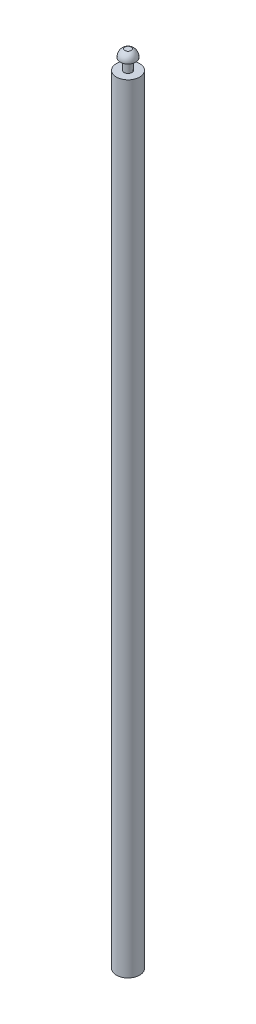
ISO-10303-21;
HEADER;
FILE_DESCRIPTION(('STEP AP214'),'2;1');
FILE_NAME('part.step','',(''),(''),'','','');
FILE_SCHEMA(('AUTOMOTIVE_DESIGN { 1 0 10303 214 1 1 1 1 }'));
ENDSEC;
DATA;
#1=APPLICATION_CONTEXT('core data for automotive mechanical design processes');
#2=APPLICATION_PROTOCOL_DEFINITION('international standard','automotive_design',2000,#1);
#3=PRODUCT_CONTEXT('',#1,'mechanical');
#4=PRODUCT('Part','Part','',(#3));
#5=PRODUCT_RELATED_PRODUCT_CATEGORY('part','',(#4));
#6=PRODUCT_DEFINITION_FORMATION('','',#4);
#7=PRODUCT_DEFINITION_CONTEXT('part definition',#1,'design');
#8=PRODUCT_DEFINITION('design','',#6,#7);
#9=PRODUCT_DEFINITION_SHAPE('','',#8);
#10=(LENGTH_UNIT() NAMED_UNIT(*) SI_UNIT(.MILLI.,.METRE.));
#11=(NAMED_UNIT(*) PLANE_ANGLE_UNIT() SI_UNIT($,.RADIAN.));
#12=(NAMED_UNIT(*) SI_UNIT($,.STERADIAN.) SOLID_ANGLE_UNIT());
#13=UNCERTAINTY_MEASURE_WITH_UNIT(LENGTH_MEASURE(1.E-05),#10,'distance_accuracy_value','');
#14=(GEOMETRIC_REPRESENTATION_CONTEXT(3) GLOBAL_UNCERTAINTY_ASSIGNED_CONTEXT((#13)) GLOBAL_UNIT_ASSIGNED_CONTEXT((#10,
#11,#12)) REPRESENTATION_CONTEXT('',''));
#15=CARTESIAN_POINT('',(0.,0.,0.));
#16=DIRECTION('',(0.,0.,1.));
#17=DIRECTION('',(1.,0.,0.));
#18=AXIS2_PLACEMENT_3D('',#15,#16,#17);
#19=CARTESIAN_POINT('',(0.,0.,0.));
#20=DIRECTION('',(0.,-1.,0.));
#21=DIRECTION('',(0.,0.,-1.));
#22=AXIS2_PLACEMENT_3D('',#19,#20,#21);
#23=CYLINDRICAL_SURFACE('',#22,0.25);
#24=CARTESIAN_POINT('',(0.,35.107250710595,0.));
#25=DIRECTION('',(0.,-1.,0.));
#26=DIRECTION('',(0.,0.,-1.));
#27=AXIS2_PLACEMENT_3D('',#24,#25,#26);
#28=CIRCLE('',#27,0.25);
#29=CARTESIAN_POINT('',(0.,35.107250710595,-0.25));
#30=VERTEX_POINT('',#29);
#31=EDGE_CURVE('E10',#30,#30,#28,.T.);
#32=ORIENTED_EDGE('',*,*,#31,.F.);
#33=EDGE_LOOP('',(#32));
#34=FACE_BOUND('',#33,.T.);
#35=CARTESIAN_POINT('',(0.,35.807250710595,0.));
#36=DIRECTION('',(0.,-1.,0.));
#37=DIRECTION('',(0.,0.,-1.));
#38=AXIS2_PLACEMENT_3D('',#35,#36,#37);
#39=CIRCLE('',#38,0.25);
#40=CARTESIAN_POINT('',(0.,35.807250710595,-0.25));
#41=VERTEX_POINT('',#40);
#42=EDGE_CURVE('E39',#41,#41,#39,.T.);
#43=ORIENTED_EDGE('',*,*,#42,.T.);
#44=EDGE_LOOP('',(#43));
#45=FACE_BOUND('',#44,.T.);
#46=ADVANCED_FACE('F33',(#34,#45),#23,.T.);
#47=CARTESIAN_POINT('',(-0.25,35.807250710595,0.));
#48=DIRECTION('',(0.,1.,0.));
#49=DIRECTION('',(0.,0.,1.));
#50=AXIS2_PLACEMENT_3D('',#47,#48,#49);
#51=PLANE('',#50);
#52=ORIENTED_EDGE('',*,*,#42,.F.);
#53=EDGE_LOOP('',(#52));
#54=FACE_BOUND('',#53,.T.);
#55=CARTESIAN_POINT('',(0.,35.807250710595,0.));
#56=DIRECTION('',(0.,-1.,0.));
#57=DIRECTION('',(0.,0.,-1.));
#58=AXIS2_PLACEMENT_3D('',#55,#56,#57);
#59=CIRCLE('',#58,0.500000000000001);
#60=CARTESIAN_POINT('',(-0.500000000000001,35.807250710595,0.));
#61=VERTEX_POINT('',#60);
#62=EDGE_CURVE('E43',#61,#61,#59,.T.);
#63=ORIENTED_EDGE('',*,*,#62,.T.);
#64=EDGE_LOOP('',(#63));
#65=FACE_BOUND('',#64,.T.);
#66=ADVANCED_FACE('F76',(#54,#65),#51,.F.);
#67=CARTESIAN_POINT('',(0.,35.847250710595,0.));
#68=DIRECTION('',(0.,-1.,0.));
#69=DIRECTION('',(-1.,0.,0.));
#70=AXIS2_PLACEMENT_3D('',#67,#68,#69);
#71=SPHERICAL_SURFACE('',#70,0.501597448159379);
#72=CARTESIAN_POINT('',(0.,36.307250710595,0.));
#73=DIRECTION('',(0.,-1.,0.));
#74=DIRECTION('',(0.,0.,-1.));
#75=AXIS2_PLACEMENT_3D('',#72,#73,#74);
#76=CIRCLE('',#75,0.2);
#77=CARTESIAN_POINT('',(-0.19999999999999,36.307250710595,0.));
#78=VERTEX_POINT('',#77);
#79=EDGE_CURVE('E47',#78,#78,#76,.T.);
#80=CARTESIAN_POINT('',(-0.500000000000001,35.807250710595,0.));
#81=CARTESIAN_POINT('',(-0.50051694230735,35.8137116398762,0.));
#82=CARTESIAN_POINT('',(-0.500908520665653,35.8201825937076,0.));
#83=CARTESIAN_POINT('',(-0.501440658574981,35.8331348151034,0.));
#84=CARTESIAN_POINT('',(-0.501581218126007,35.8396160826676,0.));
#85=CARTESIAN_POINT('',(-0.501611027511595,35.8525791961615,0.));
#86=CARTESIAN_POINT('',(-0.501500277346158,35.8590610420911,0.));
#87=CARTESIAN_POINT('',(-0.501027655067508,35.8720155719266,0.));
#88=CARTESIAN_POINT('',(-0.500665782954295,35.8784882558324,0.));
#89=CARTESIAN_POINT('',(-0.499691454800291,35.8914147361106,0.));
#90=CARTESIAN_POINT('',(-0.4990789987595,35.8978685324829,0.));
#91=CARTESIAN_POINT('',(-0.49760442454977,35.9107475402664,0.));
#92=CARTESIAN_POINT('',(-0.49674230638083,35.9171727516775,0.));
#93=CARTESIAN_POINT('',(-0.494769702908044,35.9299849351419,0.));
#94=CARTESIAN_POINT('',(-0.493659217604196,35.9363719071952,0.));
#95=CARTESIAN_POINT('',(-0.491191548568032,35.9490980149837,0.));
#96=CARTESIAN_POINT('',(-0.489834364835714,35.955437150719,0.));
#97=CARTESIAN_POINT('',(-0.486875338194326,35.968058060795,0.));
#98=CARTESIAN_POINT('',(-0.485273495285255,35.9743398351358,0.));
#99=CARTESIAN_POINT('',(-0.481827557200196,35.9868365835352,0.));
#100=CARTESIAN_POINT('',(-0.479983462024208,35.9930515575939,0.));
#101=CARTESIAN_POINT('',(-0.476055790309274,36.0054053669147,0.));
#102=CARTESIAN_POINT('',(-0.473972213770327,36.0115442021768,0.));
#103=CARTESIAN_POINT('',(-0.469568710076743,36.0237365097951,0.));
#104=CARTESIAN_POINT('',(-0.467248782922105,36.0297899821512,0.));
#105=CARTESIAN_POINT('',(-0.462376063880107,36.0418024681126,0.));
#106=CARTESIAN_POINT('',(-0.459823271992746,36.047761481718,0.));
#107=CARTESIAN_POINT('',(-0.454488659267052,36.0595760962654,0.));
#108=CARTESIAN_POINT('',(-0.451706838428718,36.0654316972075,0.));
#109=CARTESIAN_POINT('',(-0.445918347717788,36.0770306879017,0.));
#110=CARTESIAN_POINT('',(-0.442911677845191,36.082774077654,0.));
#111=CARTESIAN_POINT('',(-0.436678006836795,36.0941400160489,0.));
#112=CARTESIAN_POINT('',(-0.433451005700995,36.0997625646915,0.));
#113=CARTESIAN_POINT('',(-0.426781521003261,36.1108783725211,0.));
#114=CARTESIAN_POINT('',(-0.423339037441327,36.116371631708,0.));
#115=CARTESIAN_POINT('',(-0.416243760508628,36.1272206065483,0.));
#116=CARTESIAN_POINT('',(-0.412590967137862,36.1325763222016,0.));
#117=CARTESIAN_POINT('',(-0.405080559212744,36.1431421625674,0.));
#118=CARTESIAN_POINT('',(-0.401222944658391,36.1483522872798,0.));
#119=CARTESIAN_POINT('',(-0.39330869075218,36.1586191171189,0.));
#120=CARTESIAN_POINT('',(-0.389252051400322,36.1636758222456,0.));
#121=CARTESIAN_POINT('',(-0.380945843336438,36.1736282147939,0.));
#122=CARTESIAN_POINT('',(-0.376696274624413,36.1785239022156,0.));
#123=CARTESIAN_POINT('',(-0.368010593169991,36.1881469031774,0.));
#124=CARTESIAN_POINT('',(-0.363574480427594,36.1928742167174,0.));
#125=CARTESIAN_POINT('',(-0.35452237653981,36.2021533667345,0.));
#126=CARTESIAN_POINT('',(-0.349906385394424,36.2067052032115,0.));
#127=CARTESIAN_POINT('',(-0.340501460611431,36.2156265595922,0.));
#128=CARTESIAN_POINT('',(-0.335712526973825,36.2199960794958,0.));
#129=CARTESIAN_POINT('',(-0.325968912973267,36.2285462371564,0.));
#130=CARTESIAN_POINT('',(-0.321014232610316,36.2327268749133,0.));
#131=CARTESIAN_POINT('',(-0.310946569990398,36.2408929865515,0.));
#132=CARTESIAN_POINT('',(-0.305833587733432,36.2448784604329,0.));
#133=CARTESIAN_POINT('',(-0.29545700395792,36.2526482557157,0.));
#134=CARTESIAN_POINT('',(-0.290193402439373,36.2564325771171,0.));
#135=CARTESIAN_POINT('',(-0.279523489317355,36.2637943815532,0.));
#136=CARTESIAN_POINT('',(-0.274117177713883,36.2673718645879,0.));
#137=CARTESIAN_POINT('',(-0.263169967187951,36.2743146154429,0.));
#138=CARTESIAN_POINT('',(-0.257629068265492,36.2776798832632,0.));
#139=CARTESIAN_POINT('',(-0.246421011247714,36.2841931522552,0.));
#140=CARTESIAN_POINT('',(-0.240753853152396,36.2873411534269,0.));
#141=CARTESIAN_POINT('',(-0.229301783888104,36.2934151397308,0.));
#142=CARTESIAN_POINT('',(-0.223516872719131,36.2963411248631,0.));
#143=CARTESIAN_POINT('',(-0.211838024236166,36.3019667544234,0.));
#144=CARTESIAN_POINT('',(-0.205944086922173,36.3046663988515,0.));
#145=CARTESIAN_POINT('',(-0.19999999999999,36.307250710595,0.));
#146=B_SPLINE_CURVE_WITH_KNOTS('',3,(#80,#81,#82,#83,#84,#85,#86,#87,#88,#89,#90,#91,#92,#93,
#94,#95,#96,#97,#98,#99,#100,#101,#102,#103,#104,#105,#106,#107,#108,#109,#110,#111,#112,#113,
#114,#115,#116,#117,#118,#119,#120,#121,#122,#123,#124,#125,#126,#127,#128,#129,#130,#131,#132,
#133,#134,#135,#136,#137,#138,#139,#140,#141,#142,#143,#144,#145),.UNSPECIFIED.,.F.,.F.,(4,2,2,
2,2,2,2,2,2,2,2,2,2,2,2,2,2,2,2,2,2,2,2,2,2,2,2,2,2,2,2,2,4),(0.,0.0194435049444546,
0.0388870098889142,0.0583305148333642,0.0777740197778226,0.0972175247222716,0.116661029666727,
0.136104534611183,0.155548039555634,0.174991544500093,0.194435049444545,0.213878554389,
0.233322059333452,0.252765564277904,0.272209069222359,0.291652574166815,0.311096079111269,
0.330539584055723,0.349983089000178,0.369426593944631,0.388870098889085,0.408313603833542,
0.427757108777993,0.44720061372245,0.466644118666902,0.486087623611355,0.505531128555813,
0.524974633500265,0.54441813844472,0.563861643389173,0.583305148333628,0.602748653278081,
0.622192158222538),.UNSPECIFIED.);
#147=EDGE_CURVE('BSEAM81',#61,#78,#146,.T.);
#148=ORIENTED_EDGE('',*,*,#62,.F.);
#149=ORIENTED_EDGE('',*,*,#79,.T.);
#150=ORIENTED_EDGE('',*,*,#147,.T.);
#151=ORIENTED_EDGE('',*,*,#147,.F.);
#152=EDGE_LOOP('',(#148,#150,#149,#151));
#153=FACE_BOUND('',#152,.T.);
#154=ADVANCED_FACE('F81',(#153),#71,.T.);
#155=CARTESIAN_POINT('',(-0.2,36.307250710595,0.));
#156=DIRECTION('',(0.,-1.,0.));
#157=DIRECTION('',(0.,0.,-1.));
#158=AXIS2_PLACEMENT_3D('',#155,#156,#157);
#159=PLANE('',#158);
#160=ORIENTED_EDGE('',*,*,#79,.F.);
#161=EDGE_LOOP('',(#160));
#162=FACE_BOUND('',#161,.T.);
#163=ADVANCED_FACE('F64',(#162),#159,.F.);
#164=CARTESIAN_POINT('',(0.,-14.892749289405,0.));
#165=DIRECTION('',(0.,1.,0.));
#166=DIRECTION('',(0.,0.,1.));
#167=AXIS2_PLACEMENT_3D('',#164,#165,#166);
#168=CYLINDRICAL_SURFACE('',#167,0.75);
#169=CARTESIAN_POINT('',(0.,-14.892749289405,0.));
#170=DIRECTION('',(0.,-1.,0.));
#171=DIRECTION('',(0.,0.,-1.));
#172=AXIS2_PLACEMENT_3D('',#169,#170,#171);
#173=CIRCLE('',#172,0.75);
#174=CARTESIAN_POINT('',(0.,-14.892749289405,-0.75));
#175=VERTEX_POINT('',#174);
#176=EDGE_CURVE('E52',#175,#175,#173,.T.);
#177=ORIENTED_EDGE('',*,*,#176,.F.);
#178=EDGE_LOOP('',(#177));
#179=FACE_BOUND('',#178,.T.);
#180=CARTESIAN_POINT('',(0.,35.107250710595,0.));
#181=DIRECTION('',(0.,-1.,0.));
#182=DIRECTION('',(0.,0.,-1.));
#183=AXIS2_PLACEMENT_3D('',#180,#181,#182);
#184=CIRCLE('',#183,0.75);
#185=CARTESIAN_POINT('',(0.,35.107250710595,-0.75));
#186=VERTEX_POINT('',#185);
#187=EDGE_CURVE('E53',#186,#186,#184,.T.);
#188=ORIENTED_EDGE('',*,*,#187,.T.);
#189=EDGE_LOOP('',(#188));
#190=FACE_BOUND('',#189,.T.);
#191=ADVANCED_FACE('F61',(#179,#190),#168,.T.);
#192=CARTESIAN_POINT('',(0.,-14.892749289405,0.));
#193=DIRECTION('',(0.,-1.,0.));
#194=DIRECTION('',(0.,0.,-1.));
#195=AXIS2_PLACEMENT_3D('',#192,#193,#194);
#196=PLANE('',#195);
#197=ORIENTED_EDGE('',*,*,#176,.T.);
#198=EDGE_LOOP('',(#197));
#199=FACE_BOUND('',#198,.T.);
#200=ADVANCED_FACE('F59',(#199),#196,.T.);
#201=CARTESIAN_POINT('',(0.,35.107250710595,0.));
#202=DIRECTION('',(0.,-1.,0.));
#203=DIRECTION('',(0.,0.,-1.));
#204=AXIS2_PLACEMENT_3D('',#201,#202,#203);
#205=PLANE('',#204);
#206=ORIENTED_EDGE('',*,*,#31,.T.);
#207=EDGE_LOOP('',(#206));
#208=FACE_BOUND('',#207,.T.);
#209=ORIENTED_EDGE('',*,*,#187,.F.);
#210=EDGE_LOOP('',(#209));
#211=FACE_BOUND('',#210,.T.);
#212=ADVANCED_FACE('F68',(#208,#211),#205,.F.);
#213=CLOSED_SHELL('',(#46,#66,#154,#163,#191,#200,#212));
#214=MANIFOLD_SOLID_BREP('B2',#213);
#215=ADVANCED_BREP_SHAPE_REPRESENTATION('',(#18,#214),#14);
#216=SHAPE_DEFINITION_REPRESENTATION(#9,#215);
ENDSEC;
END-ISO-10303-21;
